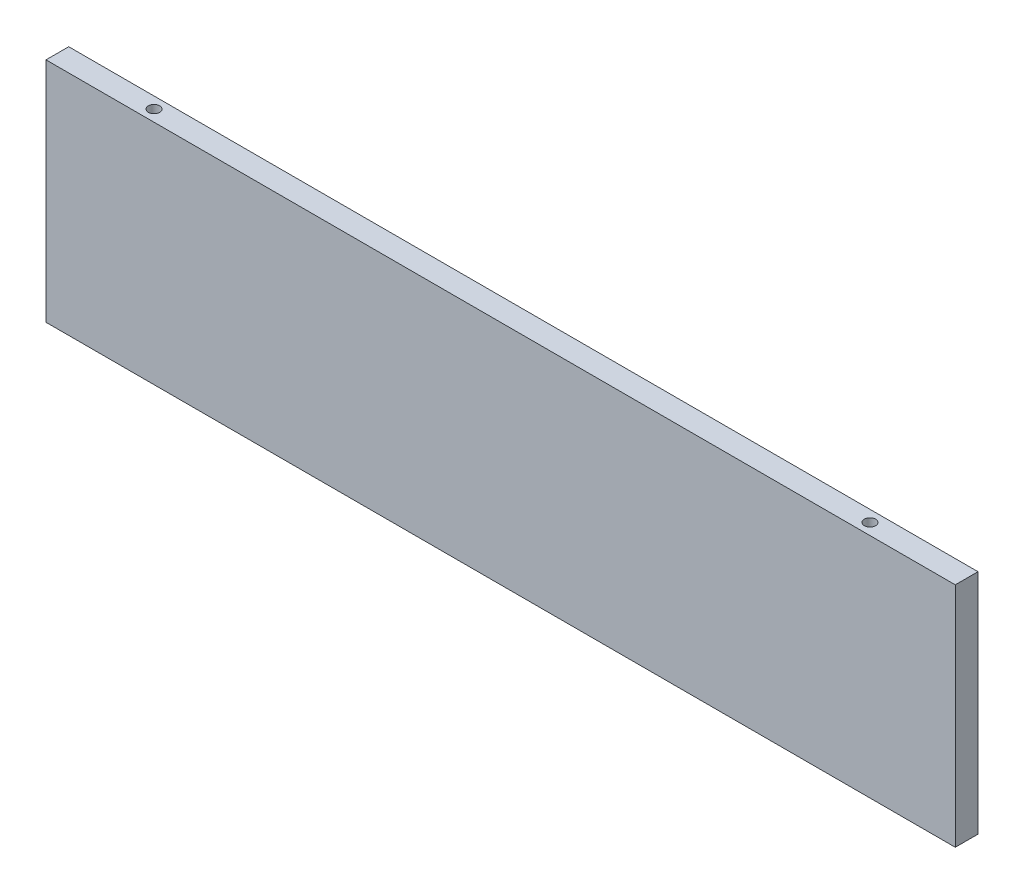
ISO-10303-21;
HEADER;
FILE_DESCRIPTION(('STEP AP214'),'2;1');
FILE_NAME('part.step','',(''),(''),'','','');
FILE_SCHEMA(('AUTOMOTIVE_DESIGN { 1 0 10303 214 1 1 1 1 }'));
ENDSEC;
DATA;
#1=APPLICATION_CONTEXT('core data for automotive mechanical design processes');
#2=APPLICATION_PROTOCOL_DEFINITION('international standard','automotive_design',2000,#1);
#3=PRODUCT_CONTEXT('',#1,'mechanical');
#4=PRODUCT('Part','Part','',(#3));
#5=PRODUCT_RELATED_PRODUCT_CATEGORY('part','',(#4));
#6=PRODUCT_DEFINITION_FORMATION('','',#4);
#7=PRODUCT_DEFINITION_CONTEXT('part definition',#1,'design');
#8=PRODUCT_DEFINITION('design','',#6,#7);
#9=PRODUCT_DEFINITION_SHAPE('','',#8);
#10=(LENGTH_UNIT() NAMED_UNIT(*) SI_UNIT(.MILLI.,.METRE.));
#11=(NAMED_UNIT(*) PLANE_ANGLE_UNIT() SI_UNIT($,.RADIAN.));
#12=(NAMED_UNIT(*) SI_UNIT($,.STERADIAN.) SOLID_ANGLE_UNIT());
#13=UNCERTAINTY_MEASURE_WITH_UNIT(LENGTH_MEASURE(1.E-05),#10,'distance_accuracy_value','');
#14=(GEOMETRIC_REPRESENTATION_CONTEXT(3) GLOBAL_UNCERTAINTY_ASSIGNED_CONTEXT((#13)) GLOBAL_UNIT_ASSIGNED_CONTEXT((#10,
#11,#12)) REPRESENTATION_CONTEXT('',''));
#15=CARTESIAN_POINT('',(0.,0.,0.));
#16=DIRECTION('',(0.,0.,1.));
#17=DIRECTION('',(1.,0.,0.));
#18=AXIS2_PLACEMENT_3D('',#15,#16,#17);
#19=CARTESIAN_POINT('',(-254.,-63.5,12.7));
#20=DIRECTION('',(1.,0.,0.));
#21=DIRECTION('',(0.,1.,0.));
#22=AXIS2_PLACEMENT_3D('',#19,#20,#21);
#23=PLANE('',#22);
#24=DIRECTION('',(0.,-1.,0.));
#25=VECTOR('',#24,1.);
#26=CARTESIAN_POINT('',(-254.,-63.5,0.));
#27=LINE('',#26,#25);
#28=CARTESIAN_POINT('',(-254.,63.5,0.));
#29=VERTEX_POINT('',#28);
#30=CARTESIAN_POINT('',(-254.,-63.5,0.));
#31=VERTEX_POINT('',#30);
#32=EDGE_CURVE('E102',#29,#31,#27,.T.);
#33=ORIENTED_EDGE('',*,*,#32,.T.);
#34=DIRECTION('',(0.,0.,-1.));
#35=VECTOR('',#34,1.);
#36=CARTESIAN_POINT('',(-254.,-63.5,12.7));
#37=LINE('',#36,#35);
#38=CARTESIAN_POINT('',(-254.,-63.5,12.7));
#39=VERTEX_POINT('',#38);
#40=EDGE_CURVE('E11',#39,#31,#37,.T.);
#41=ORIENTED_EDGE('',*,*,#40,.F.);
#42=DIRECTION('',(0.,-1.,0.));
#43=VECTOR('',#42,1.);
#44=CARTESIAN_POINT('',(-254.,-63.5,12.7));
#45=LINE('',#44,#43);
#46=CARTESIAN_POINT('',(-254.,63.5,12.7));
#47=VERTEX_POINT('',#46);
#48=EDGE_CURVE('E95',#47,#39,#45,.T.);
#49=ORIENTED_EDGE('',*,*,#48,.F.);
#50=DIRECTION('',(0.,0.,-1.));
#51=VECTOR('',#50,1.);
#52=CARTESIAN_POINT('',(-254.,63.5,12.7));
#53=LINE('',#52,#51);
#54=EDGE_CURVE('E99',#47,#29,#53,.T.);
#55=ORIENTED_EDGE('',*,*,#54,.T.);
#56=EDGE_LOOP('',(#33,#41,#49,#55));
#57=FACE_BOUND('',#56,.T.);
#58=ADVANCED_FACE('F41',(#57),#23,.F.);
#59=CARTESIAN_POINT('',(-254.,-63.5,12.7));
#60=DIRECTION('',(0.,1.,0.));
#61=DIRECTION('',(0.,0.,1.));
#62=AXIS2_PLACEMENT_3D('',#59,#60,#61);
#63=PLANE('',#62);
#64=CARTESIAN_POINT('',(-200.,-63.5,6.34999999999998));
#65=DIRECTION('',(0.,1.,0.));
#66=DIRECTION('',(0.,0.,-1.));
#67=AXIS2_PLACEMENT_3D('',#64,#65,#66);
#68=CIRCLE('',#67,3.17499999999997);
#69=CARTESIAN_POINT('',(-200.,-63.5,3.17500000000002));
#70=VERTEX_POINT('',#69);
#71=EDGE_CURVE('E124',#70,#70,#68,.T.);
#72=ORIENTED_EDGE('',*,*,#71,.T.);
#73=EDGE_LOOP('',(#72));
#74=FACE_BOUND('',#73,.T.);
#75=CARTESIAN_POINT('',(200.,-63.5,6.34999999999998));
#76=DIRECTION('',(0.,-1.,0.));
#77=DIRECTION('',(0.,0.,-1.));
#78=AXIS2_PLACEMENT_3D('',#75,#76,#77);
#79=CIRCLE('',#78,3.17499999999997);
#80=CARTESIAN_POINT('',(200.,-63.5,3.17500000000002));
#81=VERTEX_POINT('',#80);
#82=EDGE_CURVE('E116',#81,#81,#79,.T.);
#83=ORIENTED_EDGE('',*,*,#82,.F.);
#84=EDGE_LOOP('',(#83));
#85=FACE_BOUND('',#84,.T.);
#86=DIRECTION('',(1.,0.,0.));
#87=VECTOR('',#86,1.);
#88=CARTESIAN_POINT('',(-254.,-63.5,0.));
#89=LINE('',#88,#87);
#90=CARTESIAN_POINT('',(254.,-63.5,0.));
#91=VERTEX_POINT('',#90);
#92=EDGE_CURVE('E96',#31,#91,#89,.T.);
#93=ORIENTED_EDGE('',*,*,#92,.T.);
#94=DIRECTION('',(0.,0.,-1.));
#95=VECTOR('',#94,1.);
#96=CARTESIAN_POINT('',(254.,-63.5,12.7));
#97=LINE('',#96,#95);
#98=CARTESIAN_POINT('',(254.,-63.5,12.7));
#99=VERTEX_POINT('',#98);
#100=EDGE_CURVE('E47',#99,#91,#97,.T.);
#101=ORIENTED_EDGE('',*,*,#100,.F.);
#102=DIRECTION('',(1.,0.,0.));
#103=VECTOR('',#102,1.);
#104=CARTESIAN_POINT('',(-254.,-63.5,12.7));
#105=LINE('',#104,#103);
#106=EDGE_CURVE('E87',#39,#99,#105,.T.);
#107=ORIENTED_EDGE('',*,*,#106,.F.);
#108=ORIENTED_EDGE('',*,*,#40,.T.);
#109=EDGE_LOOP('',(#93,#101,#107,#108));
#110=FACE_BOUND('',#109,.T.);
#111=ADVANCED_FACE('F92',(#74,#85,#110),#63,.F.);
#112=CARTESIAN_POINT('',(254.,-63.5,12.7));
#113=DIRECTION('',(-1.,0.,0.));
#114=DIRECTION('',(0.,-1.,0.));
#115=AXIS2_PLACEMENT_3D('',#112,#113,#114);
#116=PLANE('',#115);
#117=DIRECTION('',(0.,1.,0.));
#118=VECTOR('',#117,1.);
#119=CARTESIAN_POINT('',(254.,-63.5,0.));
#120=LINE('',#119,#118);
#121=CARTESIAN_POINT('',(254.,63.5,0.));
#122=VERTEX_POINT('',#121);
#123=EDGE_CURVE('E74',#91,#122,#120,.T.);
#124=ORIENTED_EDGE('',*,*,#123,.T.);
#125=DIRECTION('',(0.,0.,-1.));
#126=VECTOR('',#125,1.);
#127=CARTESIAN_POINT('',(254.,63.5,12.7));
#128=LINE('',#127,#126);
#129=CARTESIAN_POINT('',(254.,63.5,12.7));
#130=VERTEX_POINT('',#129);
#131=EDGE_CURVE('E100',#130,#122,#128,.T.);
#132=ORIENTED_EDGE('',*,*,#131,.F.);
#133=DIRECTION('',(0.,1.,0.));
#134=VECTOR('',#133,1.);
#135=CARTESIAN_POINT('',(254.,-63.5,12.7));
#136=LINE('',#135,#134);
#137=EDGE_CURVE('E89',#99,#130,#136,.T.);
#138=ORIENTED_EDGE('',*,*,#137,.F.);
#139=ORIENTED_EDGE('',*,*,#100,.T.);
#140=EDGE_LOOP('',(#124,#132,#138,#139));
#141=FACE_BOUND('',#140,.T.);
#142=ADVANCED_FACE('F98',(#141),#116,.F.);
#143=CARTESIAN_POINT('',(-254.,63.5,12.7));
#144=DIRECTION('',(0.,-1.,0.));
#145=DIRECTION('',(0.,0.,-1.));
#146=AXIS2_PLACEMENT_3D('',#143,#144,#145);
#147=PLANE('',#146);
#148=CARTESIAN_POINT('',(-200.,63.5,6.34999999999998));
#149=DIRECTION('',(0.,1.,0.));
#150=DIRECTION('',(0.,0.,-1.));
#151=AXIS2_PLACEMENT_3D('',#148,#149,#150);
#152=CIRCLE('',#151,3.17499999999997);
#153=CARTESIAN_POINT('',(-200.,63.5,3.17500000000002));
#154=VERTEX_POINT('',#153);
#155=EDGE_CURVE('E122',#154,#154,#152,.T.);
#156=ORIENTED_EDGE('',*,*,#155,.F.);
#157=EDGE_LOOP('',(#156));
#158=FACE_BOUND('',#157,.T.);
#159=CARTESIAN_POINT('',(200.,63.5,6.34999999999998));
#160=DIRECTION('',(0.,-1.,0.));
#161=DIRECTION('',(0.,0.,-1.));
#162=AXIS2_PLACEMENT_3D('',#159,#160,#161);
#163=CIRCLE('',#162,3.17499999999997);
#164=CARTESIAN_POINT('',(200.,63.5,3.17500000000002));
#165=VERTEX_POINT('',#164);
#166=EDGE_CURVE('E110',#165,#165,#163,.T.);
#167=ORIENTED_EDGE('',*,*,#166,.T.);
#168=EDGE_LOOP('',(#167));
#169=FACE_BOUND('',#168,.T.);
#170=DIRECTION('',(-1.,0.,0.));
#171=VECTOR('',#170,1.);
#172=CARTESIAN_POINT('',(-254.,63.5,0.));
#173=LINE('',#172,#171);
#174=EDGE_CURVE('E77',#122,#29,#173,.T.);
#175=ORIENTED_EDGE('',*,*,#174,.T.);
#176=ORIENTED_EDGE('',*,*,#54,.F.);
#177=DIRECTION('',(-1.,0.,0.));
#178=VECTOR('',#177,1.);
#179=CARTESIAN_POINT('',(-254.,63.5,12.7));
#180=LINE('',#179,#178);
#181=EDGE_CURVE('E60',#130,#47,#180,.T.);
#182=ORIENTED_EDGE('',*,*,#181,.F.);
#183=ORIENTED_EDGE('',*,*,#131,.T.);
#184=EDGE_LOOP('',(#175,#176,#182,#183));
#185=FACE_BOUND('',#184,.T.);
#186=ADVANCED_FACE('F115',(#158,#169,#185),#147,.F.);
#187=CARTESIAN_POINT('',(-254.,63.5,12.7));
#188=DIRECTION('',(0.,0.,-1.));
#189=DIRECTION('',(-1.,0.,0.));
#190=AXIS2_PLACEMENT_3D('',#187,#188,#189);
#191=PLANE('',#190);
#192=ORIENTED_EDGE('',*,*,#48,.T.);
#193=ORIENTED_EDGE('',*,*,#106,.T.);
#194=ORIENTED_EDGE('',*,*,#137,.T.);
#195=ORIENTED_EDGE('',*,*,#181,.T.);
#196=EDGE_LOOP('',(#192,#193,#194,#195));
#197=FACE_BOUND('',#196,.T.);
#198=ADVANCED_FACE('F86',(#197),#191,.F.);
#199=CARTESIAN_POINT('',(-254.,63.5,0.));
#200=DIRECTION('',(0.,0.,-1.));
#201=DIRECTION('',(-1.,0.,0.));
#202=AXIS2_PLACEMENT_3D('',#199,#200,#201);
#203=PLANE('',#202);
#204=ORIENTED_EDGE('',*,*,#32,.F.);
#205=ORIENTED_EDGE('',*,*,#174,.F.);
#206=ORIENTED_EDGE('',*,*,#123,.F.);
#207=ORIENTED_EDGE('',*,*,#92,.F.);
#208=EDGE_LOOP('',(#204,#205,#206,#207));
#209=FACE_BOUND('',#208,.T.);
#210=ADVANCED_FACE('F113',(#209),#203,.T.);
#211=CARTESIAN_POINT('',(200.,63.5,6.34999999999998));
#212=DIRECTION('',(0.,-1.,0.));
#213=DIRECTION('',(0.,0.,-1.));
#214=AXIS2_PLACEMENT_3D('',#211,#212,#213);
#215=CYLINDRICAL_SURFACE('',#214,3.17499999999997);
#216=ORIENTED_EDGE('',*,*,#166,.F.);
#217=EDGE_LOOP('',(#216));
#218=FACE_BOUND('',#217,.T.);
#219=ORIENTED_EDGE('',*,*,#82,.T.);
#220=EDGE_LOOP('',(#219));
#221=FACE_BOUND('',#220,.T.);
#222=ADVANCED_FACE('F137',(#218,#221),#215,.F.);
#223=CARTESIAN_POINT('',(-200.,63.5,6.34999999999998));
#224=DIRECTION('',(0.,-1.,0.));
#225=DIRECTION('',(0.,0.,-1.));
#226=AXIS2_PLACEMENT_3D('',#223,#224,#225);
#227=CYLINDRICAL_SURFACE('',#226,3.17499999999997);
#228=ORIENTED_EDGE('',*,*,#155,.T.);
#229=EDGE_LOOP('',(#228));
#230=FACE_BOUND('',#229,.T.);
#231=ORIENTED_EDGE('',*,*,#71,.F.);
#232=EDGE_LOOP('',(#231));
#233=FACE_BOUND('',#232,.T.);
#234=ADVANCED_FACE('F128',(#230,#233),#227,.F.);
#235=CLOSED_SHELL('',(#58,#111,#142,#186,#198,#210,#222,#234));
#236=MANIFOLD_SOLID_BREP('B2',#235);
#237=ADVANCED_BREP_SHAPE_REPRESENTATION('',(#18,#236),#14);
#238=SHAPE_DEFINITION_REPRESENTATION(#9,#237);
ENDSEC;
END-ISO-10303-21;
